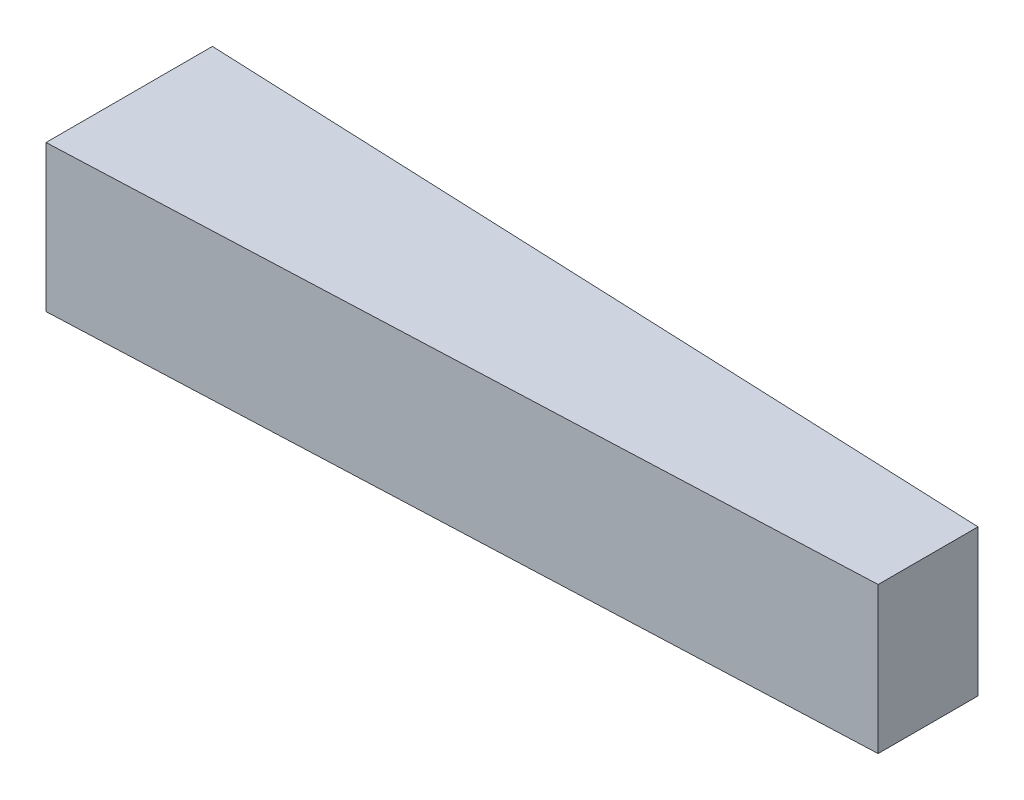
ISO-10303-21;
HEADER;
FILE_DESCRIPTION(('STEP AP214'),'2;1');
FILE_NAME('part.step','',(''),(''),'','','');
FILE_SCHEMA(('AUTOMOTIVE_DESIGN { 1 0 10303 214 1 1 1 1 }'));
ENDSEC;
DATA;
#1=APPLICATION_CONTEXT('core data for automotive mechanical design processes');
#2=APPLICATION_PROTOCOL_DEFINITION('international standard','automotive_design',2000,#1);
#3=PRODUCT_CONTEXT('',#1,'mechanical');
#4=PRODUCT('Part','Part','',(#3));
#5=PRODUCT_RELATED_PRODUCT_CATEGORY('part','',(#4));
#6=PRODUCT_DEFINITION_FORMATION('','',#4);
#7=PRODUCT_DEFINITION_CONTEXT('part definition',#1,'design');
#8=PRODUCT_DEFINITION('design','',#6,#7);
#9=PRODUCT_DEFINITION_SHAPE('','',#8);
#10=(LENGTH_UNIT() NAMED_UNIT(*) SI_UNIT(.MILLI.,.METRE.));
#11=(NAMED_UNIT(*) PLANE_ANGLE_UNIT() SI_UNIT($,.RADIAN.));
#12=(NAMED_UNIT(*) SI_UNIT($,.STERADIAN.) SOLID_ANGLE_UNIT());
#13=UNCERTAINTY_MEASURE_WITH_UNIT(LENGTH_MEASURE(1.E-05),#10,'distance_accuracy_value','');
#14=(GEOMETRIC_REPRESENTATION_CONTEXT(3) GLOBAL_UNCERTAINTY_ASSIGNED_CONTEXT((#13)) GLOBAL_UNIT_ASSIGNED_CONTEXT((#10,
#11,#12)) REPRESENTATION_CONTEXT('',''));
#15=CARTESIAN_POINT('',(0.,0.,0.));
#16=DIRECTION('',(0.,0.,1.));
#17=DIRECTION('',(1.,0.,0.));
#18=AXIS2_PLACEMENT_3D('',#15,#16,#17);
#19=CARTESIAN_POINT('',(0.,22.,0.));
#20=DIRECTION('',(0.,-1.,0.));
#21=DIRECTION('',(0.,0.,-1.));
#22=AXIS2_PLACEMENT_3D('',#19,#20,#21);
#23=PLANE('',#22);
#24=DIRECTION('',(-0.999133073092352,0.,-0.0416305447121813));
#25=VECTOR('',#24,1.);
#26=CARTESIAN_POINT('',(0.,22.,-25.));
#27=LINE('',#26,#25);
#28=CARTESIAN_POINT('',(240.,22.,-15.));
#29=VERTEX_POINT('',#28);
#30=CARTESIAN_POINT('',(0.,22.,-25.));
#31=VERTEX_POINT('',#30);
#32=EDGE_CURVE('E157',#29,#31,#27,.T.);
#33=ORIENTED_EDGE('',*,*,#32,.T.);
#34=DIRECTION('',(0.,0.,1.));
#35=VECTOR('',#34,1.);
#36=CARTESIAN_POINT('',(0.,22.,-25.));
#37=LINE('',#36,#35);
#38=CARTESIAN_POINT('',(0.,22.,25.));
#39=VERTEX_POINT('',#38);
#40=EDGE_CURVE('E160',#31,#39,#37,.T.);
#41=ORIENTED_EDGE('',*,*,#40,.T.);
#42=DIRECTION('',(0.999133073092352,0.,-0.0416305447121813));
#43=VECTOR('',#42,1.);
#44=CARTESIAN_POINT('',(240.,22.,15.));
#45=LINE('',#44,#43);
#46=CARTESIAN_POINT('',(240.,22.,15.));
#47=VERTEX_POINT('',#46);
#48=EDGE_CURVE('E163',#39,#47,#45,.T.);
#49=ORIENTED_EDGE('',*,*,#48,.T.);
#50=DIRECTION('',(0.,0.,-1.));
#51=VECTOR('',#50,1.);
#52=CARTESIAN_POINT('',(240.,22.,-15.));
#53=LINE('',#52,#51);
#54=EDGE_CURVE('E165',#47,#29,#53,.T.);
#55=ORIENTED_EDGE('',*,*,#54,.T.);
#56=EDGE_LOOP('',(#33,#41,#49,#55));
#57=FACE_BOUND('',#56,.T.);
#58=ADVANCED_FACE('F62',(#57),#23,.F.);
#59=CARTESIAN_POINT('',(0.,-22.,0.));
#60=DIRECTION('',(0.,-1.,0.));
#61=DIRECTION('',(0.,0.,-1.));
#62=AXIS2_PLACEMENT_3D('',#59,#60,#61);
#63=PLANE('',#62);
#64=DIRECTION('',(-0.999133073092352,0.,-0.0416305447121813));
#65=VECTOR('',#64,1.);
#66=CARTESIAN_POINT('',(0.,-22.,-25.));
#67=LINE('',#66,#65);
#68=CARTESIAN_POINT('',(240.,-22.,-15.));
#69=VERTEX_POINT('',#68);
#70=CARTESIAN_POINT('',(0.,-22.,-25.));
#71=VERTEX_POINT('',#70);
#72=EDGE_CURVE('E148',#69,#71,#67,.T.);
#73=ORIENTED_EDGE('',*,*,#72,.F.);
#74=DIRECTION('',(0.,0.,-1.));
#75=VECTOR('',#74,1.);
#76=CARTESIAN_POINT('',(240.,-22.,-15.));
#77=LINE('',#76,#75);
#78=CARTESIAN_POINT('',(240.,-22.,15.));
#79=VERTEX_POINT('',#78);
#80=EDGE_CURVE('E161',#79,#69,#77,.T.);
#81=ORIENTED_EDGE('',*,*,#80,.F.);
#82=DIRECTION('',(0.999133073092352,0.,-0.0416305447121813));
#83=VECTOR('',#82,1.);
#84=CARTESIAN_POINT('',(240.,-22.,15.));
#85=LINE('',#84,#83);
#86=CARTESIAN_POINT('',(0.,-22.,25.));
#87=VERTEX_POINT('',#86);
#88=EDGE_CURVE('E169',#87,#79,#85,.T.);
#89=ORIENTED_EDGE('',*,*,#88,.F.);
#90=DIRECTION('',(0.,0.,1.));
#91=VECTOR('',#90,1.);
#92=CARTESIAN_POINT('',(0.,-22.,-25.));
#93=LINE('',#92,#91);
#94=EDGE_CURVE('E152',#71,#87,#93,.T.);
#95=ORIENTED_EDGE('',*,*,#94,.F.);
#96=EDGE_LOOP('',(#73,#81,#89,#95));
#97=FACE_BOUND('',#96,.T.);
#98=ADVANCED_FACE('F187',(#97),#63,.T.);
#99=CARTESIAN_POINT('',(0.,22.,-25.));
#100=DIRECTION('',(-0.0416305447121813,0.,0.999133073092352));
#101=DIRECTION('',(0.999133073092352,0.,0.0416305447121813));
#102=AXIS2_PLACEMENT_3D('',#99,#100,#101);
#103=PLANE('',#102);
#104=ORIENTED_EDGE('',*,*,#72,.T.);
#105=DIRECTION('',(0.,-1.,0.));
#106=VECTOR('',#105,1.);
#107=CARTESIAN_POINT('',(0.,22.,-25.));
#108=LINE('',#107,#106);
#109=EDGE_CURVE('E12',#31,#71,#108,.T.);
#110=ORIENTED_EDGE('',*,*,#109,.F.);
#111=ORIENTED_EDGE('',*,*,#32,.F.);
#112=DIRECTION('',(0.,-1.,0.));
#113=VECTOR('',#112,1.);
#114=CARTESIAN_POINT('',(240.,22.,-15.));
#115=LINE('',#114,#113);
#116=EDGE_CURVE('E166',#29,#69,#115,.T.);
#117=ORIENTED_EDGE('',*,*,#116,.T.);
#118=EDGE_LOOP('',(#104,#110,#111,#117));
#119=FACE_BOUND('',#118,.T.);
#120=ADVANCED_FACE('F64',(#119),#103,.F.);
#121=CARTESIAN_POINT('',(0.,22.,-25.));
#122=DIRECTION('',(1.,0.,0.));
#123=DIRECTION('',(0.,0.,-1.));
#124=AXIS2_PLACEMENT_3D('',#121,#122,#123);
#125=PLANE('',#124);
#126=ORIENTED_EDGE('',*,*,#94,.T.);
#127=DIRECTION('',(0.,-1.,0.));
#128=VECTOR('',#127,1.);
#129=CARTESIAN_POINT('',(0.,22.,25.));
#130=LINE('',#129,#128);
#131=EDGE_CURVE('E71',#39,#87,#130,.T.);
#132=ORIENTED_EDGE('',*,*,#131,.F.);
#133=ORIENTED_EDGE('',*,*,#40,.F.);
#134=ORIENTED_EDGE('',*,*,#109,.T.);
#135=EDGE_LOOP('',(#126,#132,#133,#134));
#136=FACE_BOUND('',#135,.T.);
#137=ADVANCED_FACE('F196',(#136),#125,.F.);
#138=CARTESIAN_POINT('',(240.,22.,15.));
#139=DIRECTION('',(-0.0416305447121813,0.,-0.999133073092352));
#140=DIRECTION('',(-0.999133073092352,0.,0.0416305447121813));
#141=AXIS2_PLACEMENT_3D('',#138,#139,#140);
#142=PLANE('',#141);
#143=ORIENTED_EDGE('',*,*,#88,.T.);
#144=DIRECTION('',(0.,-1.,0.));
#145=VECTOR('',#144,1.);
#146=CARTESIAN_POINT('',(240.,22.,15.));
#147=LINE('',#146,#145);
#148=EDGE_CURVE('E174',#47,#79,#147,.T.);
#149=ORIENTED_EDGE('',*,*,#148,.F.);
#150=ORIENTED_EDGE('',*,*,#48,.F.);
#151=ORIENTED_EDGE('',*,*,#131,.T.);
#152=EDGE_LOOP('',(#143,#149,#150,#151));
#153=FACE_BOUND('',#152,.T.);
#154=ADVANCED_FACE('F181',(#153),#142,.F.);
#155=CARTESIAN_POINT('',(240.,22.,-15.));
#156=DIRECTION('',(-1.,0.,0.));
#157=DIRECTION('',(0.,0.,1.));
#158=AXIS2_PLACEMENT_3D('',#155,#156,#157);
#159=PLANE('',#158);
#160=ORIENTED_EDGE('',*,*,#80,.T.);
#161=ORIENTED_EDGE('',*,*,#116,.F.);
#162=ORIENTED_EDGE('',*,*,#54,.F.);
#163=ORIENTED_EDGE('',*,*,#148,.T.);
#164=EDGE_LOOP('',(#160,#161,#162,#163));
#165=FACE_BOUND('',#164,.T.);
#166=ADVANCED_FACE('F190',(#165),#159,.F.);
#167=CLOSED_SHELL('',(#58,#98,#120,#137,#154,#166));
#168=CARTESIAN_POINT('',(0.,12.,0.));
#169=DIRECTION('',(0.,1.,0.));
#170=DIRECTION('',(0.,0.,1.));
#171=AXIS2_PLACEMENT_3D('',#168,#169,#170);
#172=PLANE('',#171);
#173=DIRECTION('',(-0.999133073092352,0.,0.0416305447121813));
#174=VECTOR('',#173,1.);
#175=CARTESIAN_POINT('',(0.623555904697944,12.,14.9653417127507));
#176=LINE('',#175,#174);
#177=CARTESIAN_POINT('',(230.,12.,5.40798987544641));
#178=VERTEX_POINT('',#177);
#179=CARTESIAN_POINT('',(10.,12.,14.5746565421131));
#180=VERTEX_POINT('',#179);
#181=EDGE_CURVE('E128',#178,#180,#176,.T.);
#182=ORIENTED_EDGE('',*,*,#181,.T.);
#183=DIRECTION('',(0.,0.,1.));
#184=VECTOR('',#183,1.);
#185=CARTESIAN_POINT('',(10.,12.,0.));
#186=LINE('',#185,#184);
#187=CARTESIAN_POINT('',(10.,12.,-14.5746565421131));
#188=VERTEX_POINT('',#187);
#189=EDGE_CURVE('E78',#188,#180,#186,.T.);
#190=ORIENTED_EDGE('',*,*,#189,.F.);
#191=DIRECTION('',(0.999133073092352,0.,0.0416305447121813));
#192=VECTOR('',#191,1.);
#193=CARTESIAN_POINT('',(0.623555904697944,12.,-14.9653417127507));
#194=LINE('',#193,#192);
#195=CARTESIAN_POINT('',(230.,12.,-5.4079898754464));
#196=VERTEX_POINT('',#195);
#197=EDGE_CURVE('E142',#188,#196,#194,.T.);
#198=ORIENTED_EDGE('',*,*,#197,.T.);
#199=DIRECTION('',(0.,0.,1.));
#200=VECTOR('',#199,1.);
#201=CARTESIAN_POINT('',(230.,12.,0.));
#202=LINE('',#201,#200);
#203=EDGE_CURVE('E130',#196,#178,#202,.T.);
#204=ORIENTED_EDGE('',*,*,#203,.T.);
#205=EDGE_LOOP('',(#182,#190,#198,#204));
#206=FACE_BOUND('',#205,.T.);
#207=ADVANCED_FACE('F129',(#206),#172,.F.);
#208=CARTESIAN_POINT('',(0.,-12.,0.));
#209=DIRECTION('',(0.,-1.,0.));
#210=DIRECTION('',(0.,0.,-1.));
#211=AXIS2_PLACEMENT_3D('',#208,#209,#210);
#212=PLANE('',#211);
#213=DIRECTION('',(0.,0.,-1.));
#214=VECTOR('',#213,1.);
#215=CARTESIAN_POINT('',(10.,-12.,0.));
#216=LINE('',#215,#214);
#217=CARTESIAN_POINT('',(10.,-12.,14.5746565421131));
#218=VERTEX_POINT('',#217);
#219=CARTESIAN_POINT('',(10.,-12.,-14.5746565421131));
#220=VERTEX_POINT('',#219);
#221=EDGE_CURVE('E342',#218,#220,#216,.T.);
#222=ORIENTED_EDGE('',*,*,#221,.F.);
#223=DIRECTION('',(0.999133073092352,0.,-0.0416305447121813));
#224=VECTOR('',#223,1.);
#225=CARTESIAN_POINT('',(0.623555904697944,-12.,14.9653417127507));
#226=LINE('',#225,#224);
#227=CARTESIAN_POINT('',(230.,-12.,5.40798987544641));
#228=VERTEX_POINT('',#227);
#229=EDGE_CURVE('E147',#218,#228,#226,.T.);
#230=ORIENTED_EDGE('',*,*,#229,.T.);
#231=DIRECTION('',(0.,0.,-1.));
#232=VECTOR('',#231,1.);
#233=CARTESIAN_POINT('',(230.,-12.,0.));
#234=LINE('',#233,#232);
#235=CARTESIAN_POINT('',(230.,-12.,-5.4079898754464));
#236=VERTEX_POINT('',#235);
#237=EDGE_CURVE('E339',#228,#236,#234,.T.);
#238=ORIENTED_EDGE('',*,*,#237,.T.);
#239=DIRECTION('',(-0.999133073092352,0.,-0.0416305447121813));
#240=VECTOR('',#239,1.);
#241=CARTESIAN_POINT('',(0.623555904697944,-12.,-14.9653417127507));
#242=LINE('',#241,#240);
#243=EDGE_CURVE('E344',#236,#220,#242,.T.);
#244=ORIENTED_EDGE('',*,*,#243,.T.);
#245=EDGE_LOOP('',(#222,#230,#238,#244));
#246=FACE_BOUND('',#245,.T.);
#247=ADVANCED_FACE('F224',(#246),#212,.F.);
#248=CARTESIAN_POINT('',(10.,22.,-14.5746565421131));
#249=DIRECTION('',(-0.0416305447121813,0.,0.999133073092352));
#250=DIRECTION('',(0.999133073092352,0.,0.0416305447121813));
#251=AXIS2_PLACEMENT_3D('',#248,#249,#250);
#252=PLANE('',#251);
#253=DIRECTION('',(0.,-1.,0.));
#254=VECTOR('',#253,1.);
#255=CARTESIAN_POINT('',(230.,22.,-5.4079898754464));
#256=LINE('',#255,#254);
#257=EDGE_CURVE('E86',#196,#236,#256,.T.);
#258=ORIENTED_EDGE('',*,*,#257,.F.);
#259=ORIENTED_EDGE('',*,*,#197,.F.);
#260=DIRECTION('',(0.,-1.,0.));
#261=VECTOR('',#260,1.);
#262=CARTESIAN_POINT('',(10.,22.,-14.5746565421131));
#263=LINE('',#262,#261);
#264=EDGE_CURVE('E141',#188,#220,#263,.T.);
#265=ORIENTED_EDGE('',*,*,#264,.T.);
#266=ORIENTED_EDGE('',*,*,#243,.F.);
#267=EDGE_LOOP('',(#258,#259,#265,#266));
#268=FACE_BOUND('',#267,.T.);
#269=ADVANCED_FACE('F233',(#268),#252,.T.);
#270=CARTESIAN_POINT('',(230.,22.,-5.4079898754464));
#271=DIRECTION('',(-1.,0.,0.));
#272=DIRECTION('',(0.,0.,1.));
#273=AXIS2_PLACEMENT_3D('',#270,#271,#272);
#274=PLANE('',#273);
#275=DIRECTION('',(0.,-1.,0.));
#276=VECTOR('',#275,1.);
#277=CARTESIAN_POINT('',(230.,22.,5.40798987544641));
#278=LINE('',#277,#276);
#279=EDGE_CURVE('E149',#178,#228,#278,.T.);
#280=ORIENTED_EDGE('',*,*,#279,.F.);
#281=ORIENTED_EDGE('',*,*,#203,.F.);
#282=ORIENTED_EDGE('',*,*,#257,.T.);
#283=ORIENTED_EDGE('',*,*,#237,.F.);
#284=EDGE_LOOP('',(#280,#281,#282,#283));
#285=FACE_BOUND('',#284,.T.);
#286=ADVANCED_FACE('F240',(#285),#274,.T.);
#287=CARTESIAN_POINT('',(230.,22.,5.40798987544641));
#288=DIRECTION('',(-0.0416305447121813,0.,-0.999133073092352));
#289=DIRECTION('',(-0.999133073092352,0.,0.0416305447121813));
#290=AXIS2_PLACEMENT_3D('',#287,#288,#289);
#291=PLANE('',#290);
#292=DIRECTION('',(0.,-1.,0.));
#293=VECTOR('',#292,1.);
#294=CARTESIAN_POINT('',(10.,22.,14.5746565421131));
#295=LINE('',#294,#293);
#296=EDGE_CURVE('E139',#180,#218,#295,.T.);
#297=ORIENTED_EDGE('',*,*,#296,.F.);
#298=ORIENTED_EDGE('',*,*,#181,.F.);
#299=ORIENTED_EDGE('',*,*,#279,.T.);
#300=ORIENTED_EDGE('',*,*,#229,.F.);
#301=EDGE_LOOP('',(#297,#298,#299,#300));
#302=FACE_BOUND('',#301,.T.);
#303=ADVANCED_FACE('F145',(#302),#291,.T.);
#304=CARTESIAN_POINT('',(10.,22.,-14.5746565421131));
#305=DIRECTION('',(1.,0.,0.));
#306=DIRECTION('',(0.,0.,-1.));
#307=AXIS2_PLACEMENT_3D('',#304,#305,#306);
#308=PLANE('',#307);
#309=ORIENTED_EDGE('',*,*,#264,.F.);
#310=ORIENTED_EDGE('',*,*,#189,.T.);
#311=ORIENTED_EDGE('',*,*,#296,.T.);
#312=ORIENTED_EDGE('',*,*,#221,.T.);
#313=EDGE_LOOP('',(#309,#310,#311,#312));
#314=FACE_BOUND('',#313,.T.);
#315=ADVANCED_FACE('F137',(#314),#308,.T.);
#316=CLOSED_SHELL('',(#207,#247,#269,#286,#303,#315));
#317=ORIENTED_CLOSED_SHELL('',*,#316,.T.);
#318=BREP_WITH_VOIDS('B2',#167,(#317));
#319=ADVANCED_BREP_SHAPE_REPRESENTATION('',(#18,#318),#14);
#320=SHAPE_DEFINITION_REPRESENTATION(#9,#319);
ENDSEC;
END-ISO-10303-21;
